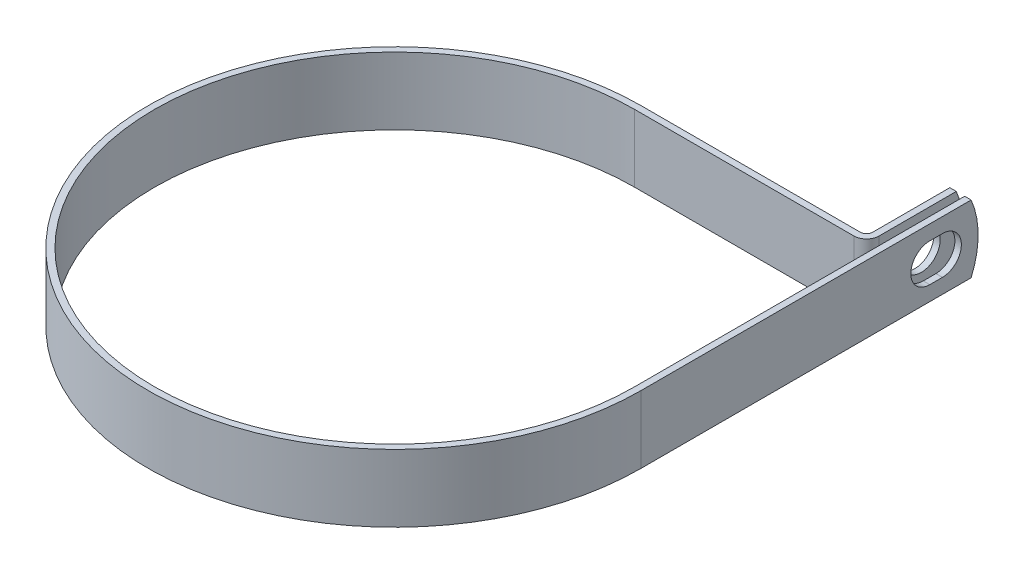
from build123d import *

# Parameters (mm, degrees)
EXTRUDE_THIN1_DEPTH = 6.35
SKETCH2_R           = 3.5687
CUT_EXTRUDE1_DEPTH  = 1.2192
CUT_EXTRUDE2_REACH  = 114.704
CUT_EXTRUDE3_DEPTH  = 110.419181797


with BuildPart() as part:
    # Sketch1 → Extrude-Thin1 (new, symmetric)
    with BuildSketch(Plane(origin=(0, 0, 0), x_dir=(1, 0, 0), z_dir=(0, 1, 0))):
        with BuildLine():
            Line((45.2374, 63.4746), (45.2374, 45.2374))
            Line((45.2374, 45.2374), (45.2374, 0))
            ThreePointArc((45.2374, 0), (-31.987672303, -31.987672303), (0, 45.2374))
            Line((0, 45.2374), (41.28516, 45.2374))
            ThreePointArc((41.28516, 45.2374), (42.966263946, 45.933736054), (43.6626, 47.61484))
            Line((43.6626, 47.61484), (43.6626, 63.4746))
            Line((43.6626, 63.4746), (42.4434, 63.4746))
            Line((42.4434, 63.4746), (42.4434, 47.61484))
            ThreePointArc((42.4434, 47.61484), (42.104159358, 46.795840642), (41.28516, 46.4566))
            Line((41.28516, 46.4566), (0, 46.4566))
            ThreePointArc((0, 46.4566), (-32.849776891, -32.849776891), (46.4566, 0))
            Line((46.4566, 0), (46.4566, 45.2374))
            Line((46.4566, 45.2374), (46.4566, 63.4746))
            Line((46.4566, 63.4746), (45.2374, 63.4746))
        make_face()
    extrude(amount=EXTRUDE_THIN1_DEPTH, both=True)

    # Sketch2 → Cut-Extrude1 (cut)
    with BuildSketch(Plane.ZY.offset(-42.4434)):
        with Locations((-55.5498, 0)):
            Circle(SKETCH2_R)
    extrude(amount=-CUT_EXTRUDE1_DEPTH, mode=Mode.SUBTRACT)

    # Sketch3 → Cut-Extrude2 (cut, up to next)
    with BuildSketch(Plane(origin=(46.4566, 0, 0), x_dir=(0, 0, -1), z_dir=(1, 0, 0)), mode=Mode.PRIVATE) as cut_extrude2_sk1:
        with BuildLine():
            Line((54.356, 3.5687), (56.7436, 3.5687))
            ThreePointArc((56.7436, 3.5687), (60.3123, 0), (56.7436, -3.5687))
            Line((56.7436, -3.5687), (54.356, -3.5687))
            ThreePointArc((54.356, -3.5687), (50.7873, 0), (54.356, 3.5687))
        make_face()
    cut_extrude2_tool1 = extrude(cut_extrude2_sk1.sketch, amount=-CUT_EXTRUDE2_REACH, mode=Mode.PRIVATE) & part.part
    add(cut_extrude2_tool1.solids().sort_by_distance((46.4566, 0, -55.5498))[0], mode=Mode.SUBTRACT)

    # Sketch4 → Cut-Extrude3 (cut, through all)
    with BuildSketch(Plane.ZY.offset(-42.4434)):
        with BuildLine():
            Line((-62.149277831, 6.35), (-63.4746, 6.35))
            Line((-63.4746, 6.35), (-63.4746, 0))
            ThreePointArc((-63.4746, 0), (-63.139737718, 3.243415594), (-62.149277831, 6.35))
        make_face()
        with BuildLine():
            ThreePointArc((-62.149277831, -6.35), (-63.139737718, -3.243415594), (-63.4746, 0))
            Line((-63.4746, 0), (-63.4746, -6.35))
            Line((-63.4746, -6.35), (-62.149277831, -6.35))
        make_face()
    extrude(amount=-CUT_EXTRUDE3_DEPTH, mode=Mode.SUBTRACT)


solid = part.part
